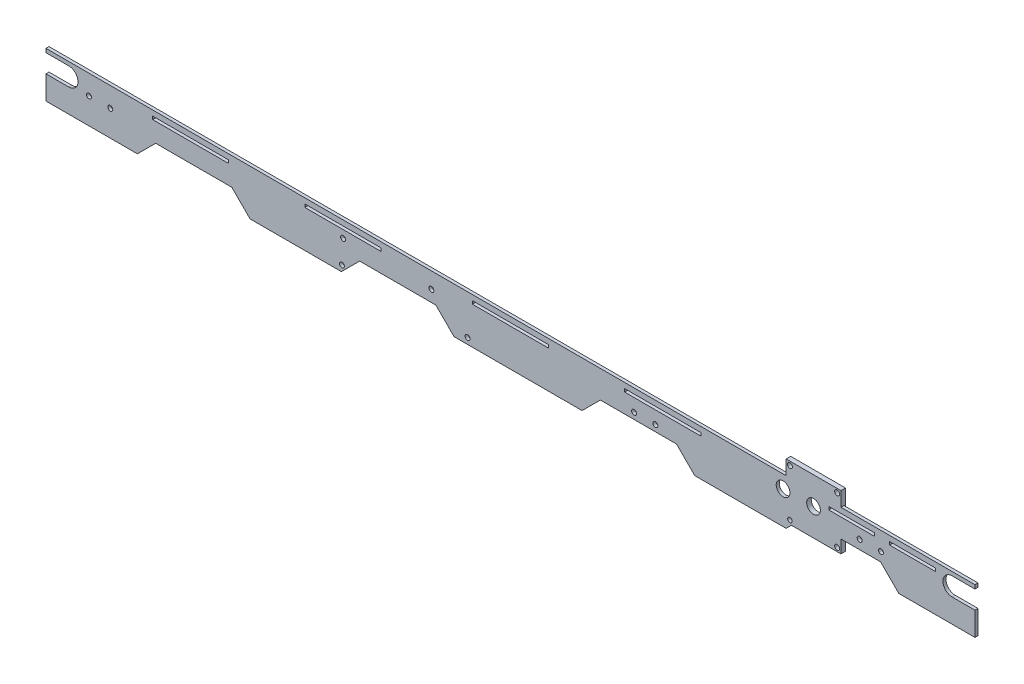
from build123d import *

# Parameters (mm, degrees)
SALIENTE_EXTRUIR1_DEPTH = 2
CROQUIS4_W              = 50
CROQUIS4_H              = 2
CORTAR_EXTRUIR1_DEPTH   = 5
CROQUIS6_R              = 4.5
CORTAR_EXTRUIR3_DEPTH   = 3
SALIENTE_EXTRUIR2_START = -3
CROQUIS7_W              = 36
CROQUIS7_H              = 36
CROQUIS7_R              = 4.5
CROQUIS7_R_2            = 1.625
SALIENTE_EXTRUIR2_DEPTH = 3
CROQUIS8_R              = 1.5
CROQUIS8_R_2            = 3.6
CORTAR_EXTRUIR4_DEPTH   = 3
CROQUIS10_W             = 10
CROQUIS10_H             = 30
SALIENTE_EXTRUIR3_DEPTH = 2
CROQUIS20_R             = 1.625
CORTAR_EXTRUIR15_DEPTH  = 10
CROQUIS21_R             = 1.625
CORTAR_EXTRUIR16_DEPTH  = 3
CROQUIS22_R             = 1.625
CORTAR_EXTRUIR17_DEPTH  = 3
CROQUIS23_R             = 1.625
CORTAR_EXTRUIR18_DEPTH  = 3
CORTAR_EXTRUIR20_DEPTH  = 3
CROQUIS27_R             = 4.5
CORTAR_EXTRUIR21_DEPTH  = 3
CROQUIS28_W             = 30
CROQUIS28_H             = 2
CORTAR_EXTRUIR22_DEPTH  = 3
SKETCH1_R               = 1.6
CUT_EXTRUDE1_DEPTH      = 5


with BuildPart() as part:
    # Croquis1 → Saliente-Extruir1 (new body)
    with BuildSketch(Plane.XY):
        Polygon((-300, 3), (300, 3), (300, -27), (250, -27), (238, -15), (188, -15), (176, -27), (116.02, -27), (104.02, -15), (54.02, -15), (42.02, -27), (-42.02, -27), (-54.02, -15), (-104.02, -15), (-116.02, -27), (-176, -27), (-188, -15), (-238, -15), (-250, -27), (-300, -27), align=None)
    extrude(amount=SALIENTE_EXTRUIR1_DEPTH)

    # Croquis4 → Cortar-Extruir1 (cut)
    with BuildSketch(Plane.XY.offset(2)):
        with Locations((-215, -1.5)):
            Rectangle(CROQUIS4_W, CROQUIS4_H)
        with Locations((-115, -1.5)):
            Rectangle(CROQUIS4_W, CROQUIS4_H)
        with Locations((-5, -1.5)):
            Rectangle(CROQUIS4_W, CROQUIS4_H)
        with Locations((95, -1.5)):
            Rectangle(CROQUIS4_W, CROQUIS4_H)
    extrude(amount=-CORTAR_EXTRUIR1_DEPTH, mode=Mode.SUBTRACT)

    # Croquis6 → Cortar-Extruir3 (cut)
    with BuildSketch(Plane(origin=(0, 0, 0), x_dir=(-1, 0, 0), z_dir=(0, 0, -1))):
        with Locations((-194, -5.5)):
            Circle(CROQUIS6_R)
    extrude(amount=-CORTAR_EXTRUIR3_DEPTH, mode=Mode.SUBTRACT)

    # Croquis7 → Saliente-Extruir2 (add)
    with BuildSketch(Plane.XY.offset(2).offset(SALIENTE_EXTRUIR2_START)):
        with Locations((194, -5.5)):
            Rectangle(CROQUIS7_W, CROQUIS7_H)
        with Locations(Location((194, -5.5, 0), (0, 0, 180))):
            Circle(CROQUIS7_R, mode=Mode.SUBTRACT)
        with Locations((178.5, 10)):
            Circle(CROQUIS7_R_2, mode=Mode.SUBTRACT)
        with Locations((209.5, 10)):
            Circle(CROQUIS7_R_2, mode=Mode.SUBTRACT)
        with Locations(Location((209.5, -21, 0), (0, 0, 180))):
            Circle(CROQUIS7_R_2, mode=Mode.SUBTRACT)
        with Locations(Location((178.5, -21, 0), (0, 0, 180))):
            Circle(CROQUIS7_R_2, mode=Mode.SUBTRACT)
    extrude(amount=SALIENTE_EXTRUIR2_DEPTH)

    # Croquis8 → Cortar-Extruir4 (cut)
    with BuildSketch(Plane.XY.offset(2)):
        with Locations((178.5, 10)):
            Circle(CROQUIS8_R)
        with Locations((194, -5.5)):
            Circle(CROQUIS8_R_2)
        with Locations(Location((178.5, -21, 0), (0, 0, 180))):
            Circle(CROQUIS8_R)
    extrude(amount=-CORTAR_EXTRUIR4_DEPTH, mode=Mode.SUBTRACT)

    # Croquis10 → Saliente-Extruir3 (add)
    with BuildSketch(Plane.XY.offset(2)):
        with Locations((-305, -12)):
            Rectangle(CROQUIS10_W, CROQUIS10_H)
    extrude(amount=-SALIENTE_EXTRUIR3_DEPTH)

    # Croquis20 → Cortar-Extruir15 (cut)
    with BuildSketch(Plane(origin=(0, 0, 0), x_dir=(-1, 0, 0), z_dir=(0, 0, -1))):
        with Locations((114.935059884, -7.5)):
            Circle(CROQUIS20_R)
        with Locations((56.935059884, -7.5)):
            Circle(CROQUIS20_R)
    extrude(amount=-CORTAR_EXTRUIR15_DEPTH, mode=Mode.SUBTRACT)

    # Croquis21 → Cortar-Extruir16 (cut)
    with BuildSketch(Plane(origin=(0, 0, 0), x_dir=(-1, 0, 0), z_dir=(0, 0, -1))):
        with Locations((-76.137704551, -10.883898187)):
            Circle(CROQUIS21_R)
        with Locations((-90.137704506, -10.883898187)):
            Circle(CROQUIS21_R)
    extrude(amount=-CORTAR_EXTRUIR16_DEPTH, mode=Mode.SUBTRACT)

    # Croquis22 → Cortar-Extruir17 (cut)
    with BuildSketch(Plane.XY.offset(2)):
        with Locations((224.273370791, -9)):
            Circle(CROQUIS22_R)
        with Locations((238.273370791, -9)):
            Circle(CROQUIS22_R)
    extrude(amount=-CORTAR_EXTRUIR17_DEPTH, mode=Mode.SUBTRACT)

    # Croquis23 → Cortar-Extruir18 (cut)
    with BuildSketch(Plane.XY.offset(2)):
        with Locations((-281.772260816, -10)):
            Circle(CROQUIS23_R)
        with Locations((-267.772260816, -10)):
            Circle(CROQUIS23_R)
    extrude(amount=-CORTAR_EXTRUIR18_DEPTH, mode=Mode.SUBTRACT)

    # Croquis25 → Cortar-Extruir20 (cut)
    with BuildSketch(Plane.XY.offset(2)):
        with BuildLine():
            Line((-295, 0.5), (-310, 0.5))
            Line((-310, 0.5), (-310, -11.5))
            Line((-310, -11.5), (-295, -11.5))
            ThreePointArc((-295, -11.5), (-289, -5.5), (-295, 0.5))
        make_face()
        with BuildLine():
            Line((300, -11.5), (285, -11.5))
            ThreePointArc((285, -11.5), (279, -5.5), (285, 0.5))
            Line((285, 0.5), (300, 0.5))
            Line((300, 0.5), (300, -11.5))
        make_face()
    extrude(amount=-CORTAR_EXTRUIR20_DEPTH, mode=Mode.SUBTRACT)

    # Croquis27 → Cortar-Extruir21 (cut)
    with BuildSketch(Plane.XY.offset(2)):
        with Locations((174, -5.5)):
            Circle(CROQUIS27_R)
    extrude(amount=-CORTAR_EXTRUIR21_DEPTH, mode=Mode.SUBTRACT)

    # Croquis28 → Cortar-Extruir22 (cut)
    with BuildSketch(Plane(origin=(0, 0, 0), x_dir=(-1, 0, 0), z_dir=(0, 0, -1))):
        with Locations((-259, -1.5)):
            Rectangle(CROQUIS28_W, CROQUIS28_H)
        with Locations((-219, -1.5)):
            Rectangle(CROQUIS28_W, CROQUIS28_H)
    extrude(amount=-CORTAR_EXTRUIR22_DEPTH, mode=Mode.SUBTRACT)

    # Sketch1 → Cut-Extrude1 (cut)
    with BuildSketch(Plane(origin=(0, 0, 0), x_dir=(-1, 0, 0), z_dir=(0, 0, -1))):
        with Locations((33.190713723, -23)):
            Circle(SKETCH1_R)
        with Locations((115.65020331, -23)):
            Circle(SKETCH1_R)
    extrude(amount=-CUT_EXTRUDE1_DEPTH, mode=Mode.SUBTRACT)


solid = part.part
